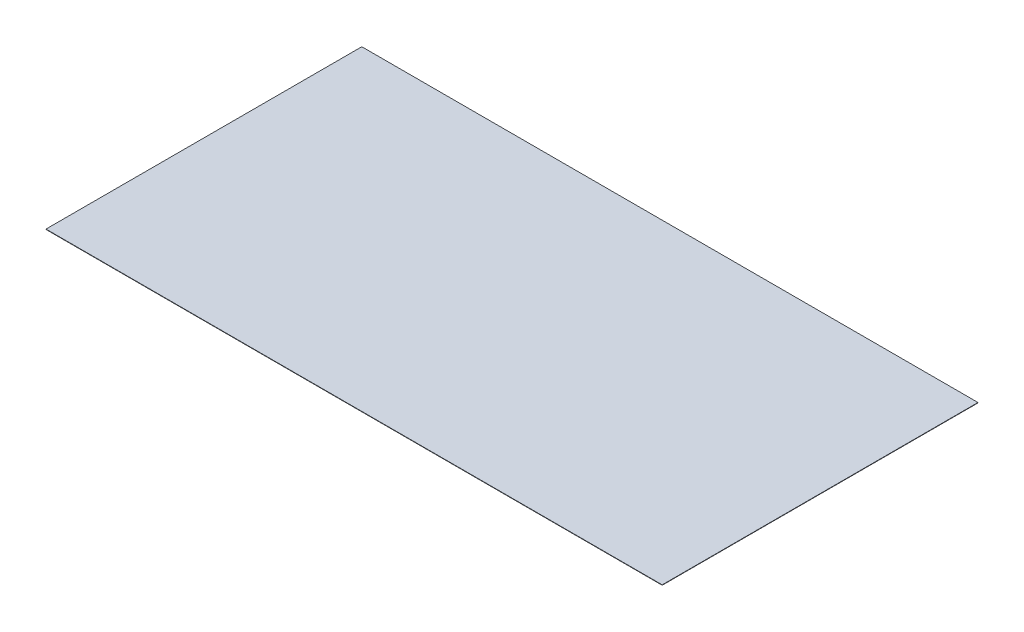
from build123d import *

# Parameters (mm, degrees)
SKETCH1_W           = 80
SKETCH1_H           = 41
BOSS_EXTRUDE1_DEPTH = 0.05


with BuildPart() as part:
    # Sketch1 → Boss-Extrude1 (new body)
    with BuildSketch(Plane(origin=(0, 0, 0), x_dir=(1, 0, 0), z_dir=(0, 1, 0))):
        with Locations((40, 20.5)):
            Rectangle(SKETCH1_W, SKETCH1_H)
    extrude(amount=BOSS_EXTRUDE1_DEPTH)


solid = part.part
